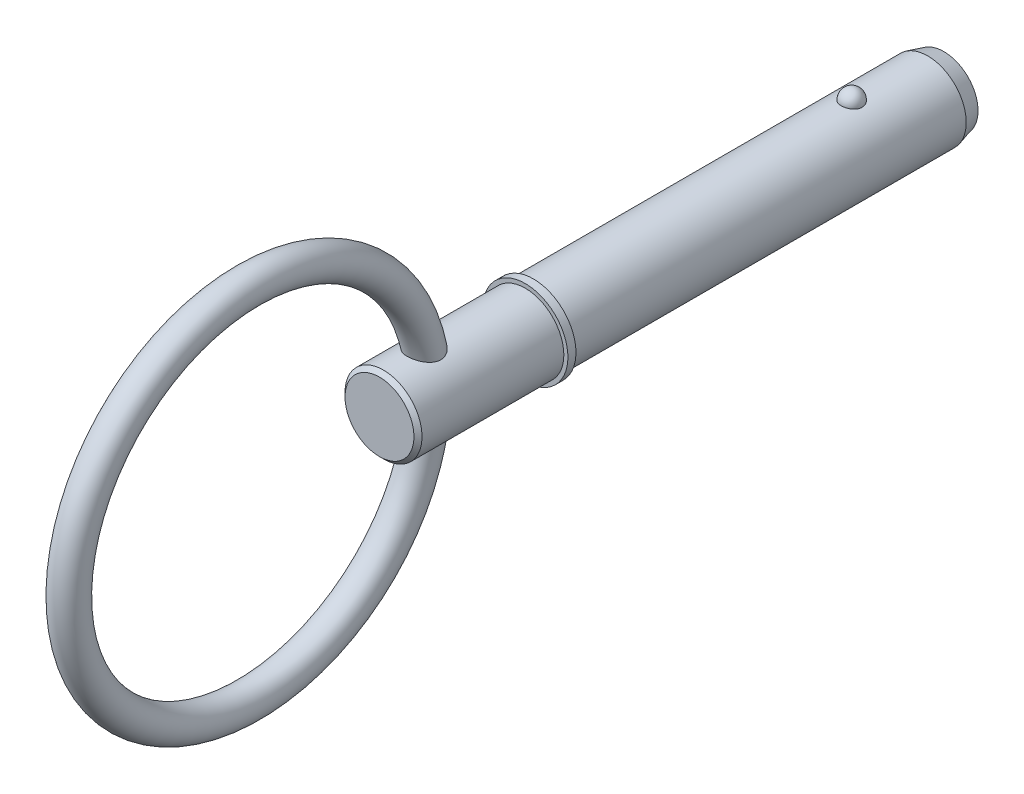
ISO-10303-21;
HEADER;
FILE_DESCRIPTION(('STEP AP214'),'2;1');
FILE_NAME('part.step','',(''),(''),'','','');
FILE_SCHEMA(('AUTOMOTIVE_DESIGN { 1 0 10303 214 1 1 1 1 }'));
ENDSEC;
DATA;
#1=APPLICATION_CONTEXT('core data for automotive mechanical design processes');
#2=APPLICATION_PROTOCOL_DEFINITION('international standard','automotive_design',2000,#1);
#3=PRODUCT_CONTEXT('',#1,'mechanical');
#4=PRODUCT('Part','Part','',(#3));
#5=PRODUCT_RELATED_PRODUCT_CATEGORY('part','',(#4));
#6=PRODUCT_DEFINITION_FORMATION('','',#4);
#7=PRODUCT_DEFINITION_CONTEXT('part definition',#1,'design');
#8=PRODUCT_DEFINITION('design','',#6,#7);
#9=PRODUCT_DEFINITION_SHAPE('','',#8);
#10=(LENGTH_UNIT() NAMED_UNIT(*) SI_UNIT(.MILLI.,.METRE.));
#11=(NAMED_UNIT(*) PLANE_ANGLE_UNIT() SI_UNIT($,.RADIAN.));
#12=(NAMED_UNIT(*) SI_UNIT($,.STERADIAN.) SOLID_ANGLE_UNIT());
#13=UNCERTAINTY_MEASURE_WITH_UNIT(LENGTH_MEASURE(1.E-05),#10,'distance_accuracy_value','');
#14=(GEOMETRIC_REPRESENTATION_CONTEXT(3) GLOBAL_UNCERTAINTY_ASSIGNED_CONTEXT((#13)) GLOBAL_UNIT_ASSIGNED_CONTEXT((#10,
#11,#12)) REPRESENTATION_CONTEXT('',''));
#15=CARTESIAN_POINT('',(0.,0.,0.));
#16=DIRECTION('',(0.,0.,1.));
#17=DIRECTION('',(1.,0.,0.));
#18=AXIS2_PLACEMENT_3D('',#15,#16,#17);
#19=CARTESIAN_POINT('',(0.,0.,38.1));
#20=DIRECTION('',(0.,0.,-1.));
#21=DIRECTION('',(-1.,0.,0.));
#22=AXIS2_PLACEMENT_3D('',#19,#20,#21);
#23=CYLINDRICAL_SURFACE('',#22,4.765);
#24=CARTESIAN_POINT('',(1.27812710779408,4.59038300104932,-1.29));
#25=CARTESIAN_POINT('',(1.27812572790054,4.59038414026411,-1.2178688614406));
#26=CARTESIAN_POINT('',(1.27223018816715,4.59203736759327,-1.14572000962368));
#27=CARTESIAN_POINT('',(1.24878929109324,4.59846646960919,-1.00346315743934));
#28=CARTESIAN_POINT('',(1.23123896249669,4.60324367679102,-0.933356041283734));
#29=CARTESIAN_POINT('',(1.18493861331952,4.61537801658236,-0.797215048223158));
#30=CARTESIAN_POINT('',(1.15619354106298,4.62273400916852,-0.731179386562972));
#31=CARTESIAN_POINT('',(1.08822596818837,4.6392032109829,-0.60498645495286));
#32=CARTESIAN_POINT('',(1.04900384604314,4.64831635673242,-0.544828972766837));
#33=CARTESIAN_POINT('',(0.960865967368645,4.66733302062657,-0.431775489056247));
#34=CARTESIAN_POINT('',(0.911906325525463,4.67723999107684,-0.37891426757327));
#35=CARTESIAN_POINT('',(0.805678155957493,4.69670280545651,-0.282245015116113));
#36=CARTESIAN_POINT('',(0.748409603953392,4.70625864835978,-0.238437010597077));
#37=CARTESIAN_POINT('',(0.627266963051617,4.72392767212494,-0.161207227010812));
#38=CARTESIAN_POINT('',(0.563411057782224,4.73204466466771,-0.127757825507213));
#39=CARTESIAN_POINT('',(0.430755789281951,4.74595788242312,-0.072047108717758));
#40=CARTESIAN_POINT('',(0.361956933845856,4.75175434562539,-0.0497846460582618));
#41=CARTESIAN_POINT('',(0.222605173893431,4.76030056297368,-0.017375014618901));
#42=CARTESIAN_POINT('',(0.152101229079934,4.76309991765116,-0.00703038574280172));
#43=CARTESIAN_POINT('',(0.0103009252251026,4.76551622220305,0.00191361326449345));
#44=CARTESIAN_POINT('',(-0.0609953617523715,4.76513345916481,0.000514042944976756));
#45=CARTESIAN_POINT('',(-0.201348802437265,4.76125496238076,-0.0138891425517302));
#46=CARTESIAN_POINT('',(-0.270423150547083,4.75780093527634,-0.0267372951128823));
#47=CARTESIAN_POINT('',(-0.405377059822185,4.74820737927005,-0.0634598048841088));
#48=CARTESIAN_POINT('',(-0.471256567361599,4.74206780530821,-0.087334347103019));
#49=CARTESIAN_POINT('',(-0.598375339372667,4.72771507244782,-0.145611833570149));
#50=CARTESIAN_POINT('',(-0.659587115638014,4.71949070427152,-0.180071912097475));
#51=CARTESIAN_POINT('',(-0.775356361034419,4.70185936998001,-0.258542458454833));
#52=CARTESIAN_POINT('',(-0.829913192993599,4.69245229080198,-0.302553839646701));
#53=CARTESIAN_POINT('',(-0.931895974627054,4.67327936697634,-0.39982907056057));
#54=CARTESIAN_POINT('',(-0.979176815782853,4.66351011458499,-0.453244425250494));
#55=CARTESIAN_POINT('',(-1.06421220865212,4.64484426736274,-0.567321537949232));
#56=CARTESIAN_POINT('',(-1.10196613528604,4.63594772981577,-0.6279837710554));
#57=CARTESIAN_POINT('',(-1.16735225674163,4.61992036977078,-0.75558557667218));
#58=CARTESIAN_POINT('',(-1.19487251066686,4.61280933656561,-0.822585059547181));
#59=CARTESIAN_POINT('',(-1.23851975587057,4.60128324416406,-0.96041771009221));
#60=CARTESIAN_POINT('',(-1.25464705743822,4.59686811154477,-1.03125077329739));
#61=CARTESIAN_POINT('',(-1.27505790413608,4.59124882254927,-1.17443804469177));
#62=CARTESIAN_POINT('',(-1.27938868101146,4.59003186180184,-1.24678501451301));
#63=CARTESIAN_POINT('',(-1.27623192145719,4.5909105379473,-1.3911989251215));
#64=CARTESIAN_POINT('',(-1.26874468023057,4.59300609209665,-1.46326587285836));
#65=CARTESIAN_POINT('',(-1.24220427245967,4.60025423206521,-1.60473192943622));
#66=CARTESIAN_POINT('',(-1.2232043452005,4.60539274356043,-1.67414176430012));
#67=CARTESIAN_POINT('',(-1.17415910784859,4.61813957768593,-1.80870154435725));
#68=CARTESIAN_POINT('',(-1.1441133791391,4.62574799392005,-1.87385132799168));
#69=CARTESIAN_POINT('',(-1.07354327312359,4.64263368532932,-1.99841604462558));
#70=CARTESIAN_POINT('',(-1.03296580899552,4.65191934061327,-2.05779976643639));
#71=CARTESIAN_POINT('',(-0.942433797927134,4.67110036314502,-2.16881966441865));
#72=CARTESIAN_POINT('',(-0.892478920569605,4.68099575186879,-2.22045556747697));
#73=CARTESIAN_POINT('',(-0.784302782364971,4.70033161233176,-2.31471696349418));
#74=CARTESIAN_POINT('',(-0.726054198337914,4.70977043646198,-2.35731146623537));
#75=CARTESIAN_POINT('',(-0.602997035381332,4.72709995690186,-2.43206620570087));
#76=CARTESIAN_POINT('',(-0.538188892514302,4.73499075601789,-2.46422713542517));
#77=CARTESIAN_POINT('',(-0.404639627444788,4.7482563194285,-2.51687454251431));
#78=CARTESIAN_POINT('',(-0.33595386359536,4.7536596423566,-2.53749415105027));
#79=CARTESIAN_POINT('',(-0.195948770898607,4.76148510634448,-2.56703727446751));
#80=CARTESIAN_POINT('',(-0.124629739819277,4.76390758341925,-2.57596210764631));
#81=CARTESIAN_POINT('',(0.0172696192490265,4.76548774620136,-2.58180339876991));
#82=CARTESIAN_POINT('',(0.0878407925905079,4.76470225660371,-2.57892886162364));
#83=CARTESIAN_POINT('',(0.227467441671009,4.76008019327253,-2.56172603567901));
#84=CARTESIAN_POINT('',(0.296522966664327,4.75624371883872,-2.54739811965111));
#85=CARTESIAN_POINT('',(0.430942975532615,4.74595041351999,-2.50776251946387));
#86=CARTESIAN_POINT('',(0.496319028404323,4.7395023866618,-2.4824917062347));
#87=CARTESIAN_POINT('',(0.621860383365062,4.72467083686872,-2.4216730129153));
#88=CARTESIAN_POINT('',(0.682025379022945,4.71628720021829,-2.38612452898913));
#89=CARTESIAN_POINT('',(0.796409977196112,4.69833598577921,-2.30511163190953));
#90=CARTESIAN_POINT('',(0.850529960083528,4.68875291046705,-2.25951003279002));
#91=CARTESIAN_POINT('',(0.950412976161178,4.66953243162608,-2.15992428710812));
#92=CARTESIAN_POINT('',(0.996174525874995,4.65989501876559,-2.10593865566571));
#93=CARTESIAN_POINT('',(1.07885962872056,4.64145616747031,-1.99009376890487));
#94=CARTESIAN_POINT('',(1.11562789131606,4.63267081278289,-1.92812106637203));
#95=CARTESIAN_POINT('',(1.17840570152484,4.61710269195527,-1.79873681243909));
#96=CARTESIAN_POINT('',(1.20441973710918,4.61031909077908,-1.73132754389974));
#97=CARTESIAN_POINT('',(1.24242116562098,4.60021170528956,-1.60192906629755));
#98=CARTESIAN_POINT('',(1.25578772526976,4.59655387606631,-1.54036674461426));
#99=CARTESIAN_POINT('',(1.27364121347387,4.59163904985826,-1.41587409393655));
#100=CARTESIAN_POINT('',(1.2781283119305,4.59038200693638,-1.35294379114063));
#101=CARTESIAN_POINT('',(1.27812710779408,4.59038300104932,-1.29));
#102=B_SPLINE_CURVE_WITH_KNOTS('',3,(#24,#25,#26,#27,#28,#29,#30,#31,#32,#33,#34,#35,#36,#37,
#38,#39,#40,#41,#42,#43,#44,#45,#46,#47,#48,#49,#50,#51,#52,#53,#54,#55,#56,#57,#58,#59,#60,#61,
#62,#63,#64,#65,#66,#67,#68,#69,#70,#71,#72,#73,#74,#75,#76,#77,#78,#79,#80,#81,#82,#83,#84,#85,
#86,#87,#88,#89,#90,#91,#92,#93,#94,#95,#96,#97,#98,#99,#100,#101),.UNSPECIFIED.,.T.,.F.,(4,2,2,
2,2,2,2,2,2,2,2,2,2,2,2,2,2,2,2,2,2,2,2,2,2,2,2,2,2,2,2,2,2,2,2,2,2,2,4),(0.,0.216167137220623,
0.432426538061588,0.648590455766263,0.864746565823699,1.0818998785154,1.29905382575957,
1.51562361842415,1.73217119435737,1.94507683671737,2.15796327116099,2.36800220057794,
2.57804465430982,2.78924132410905,3.00045819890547,3.21545551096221,3.43046692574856,
3.64776550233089,3.8650581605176,4.08147951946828,4.29789547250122,4.51331818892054,
4.72874907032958,4.94528769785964,5.16183395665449,5.37911087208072,5.59637335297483,
5.8110751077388,6.02575265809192,6.23664413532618,6.44752874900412,6.65770827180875,
6.86790014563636,7.08116060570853,7.29445887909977,7.51121476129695,7.72788009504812,
7.91651762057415,8.10515153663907),.UNSPECIFIED.);
#103=CARTESIAN_POINT('',(1.27812710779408,4.59038300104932,-1.29));
#104=VERTEX_POINT('',#103);
#105=EDGE_CURVE('E102',#104,#104,#102,.T.);
#106=ORIENTED_EDGE('',*,*,#105,.T.);
#107=EDGE_LOOP('',(#106));
#108=FACE_BOUND('',#107,.T.);
#109=CARTESIAN_POINT('',(0.,0.,-10.7));
#110=DIRECTION('',(0.,0.,-1.));
#111=DIRECTION('',(-1.,0.,0.));
#112=AXIS2_PLACEMENT_3D('',#109,#110,#111);
#113=CIRCLE('',#112,4.765);
#114=CARTESIAN_POINT('',(-4.765,0.,-10.7));
#115=VERTEX_POINT('',#114);
#116=EDGE_CURVE('E110',#115,#115,#113,.F.);
#117=ORIENTED_EDGE('',*,*,#116,.T.);
#118=EDGE_LOOP('',(#117));
#119=FACE_BOUND('',#118,.T.);
#120=CARTESIAN_POINT('',(0.,0.,38.1));
#121=DIRECTION('',(0.,0.,1.));
#122=DIRECTION('',(1.,0.,0.));
#123=AXIS2_PLACEMENT_3D('',#120,#121,#122);
#124=CIRCLE('',#123,4.765);
#125=CARTESIAN_POINT('',(4.765,0.,38.1));
#126=VERTEX_POINT('',#125);
#127=EDGE_CURVE('E108',#126,#126,#124,.T.);
#128=ORIENTED_EDGE('',*,*,#127,.F.);
#129=EDGE_LOOP('',(#128));
#130=FACE_BOUND('',#129,.T.);
#131=ADVANCED_FACE('F39',(#108,#119,#130),#23,.T.);
#132=CARTESIAN_POINT('',(0.,0.,-12.7));
#133=DIRECTION('',(0.,0.,-1.));
#134=DIRECTION('',(-1.,0.,0.));
#135=AXIS2_PLACEMENT_3D('',#132,#133,#134);
#136=PLANE('',#135);
#137=CARTESIAN_POINT('',(0.,0.,-12.7));
#138=DIRECTION('',(0.,0.,-1.));
#139=DIRECTION('',(-1.,0.,0.));
#140=AXIS2_PLACEMENT_3D('',#137,#138,#139);
#141=CIRCLE('',#140,4.22910161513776);
#142=CARTESIAN_POINT('',(-4.22910161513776,0.,-12.7));
#143=VERTEX_POINT('',#142);
#144=EDGE_CURVE('E142',#143,#143,#141,.T.);
#145=ORIENTED_EDGE('',*,*,#144,.T.);
#146=EDGE_LOOP('',(#145));
#147=FACE_BOUND('',#146,.T.);
#148=ADVANCED_FACE('F88',(#147),#136,.T.);
#149=CARTESIAN_POINT('',(0.,0.,-12.7));
#150=DIRECTION('',(0.,0.,1.));
#151=DIRECTION('',(1.,0.,0.));
#152=AXIS2_PLACEMENT_3D('',#149,#150,#151);
#153=CONICAL_SURFACE('',#152,4.22910161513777,0.261799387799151);
#154=ORIENTED_EDGE('',*,*,#116,.F.);
#155=EDGE_LOOP('',(#154));
#156=FACE_BOUND('',#155,.T.);
#157=ORIENTED_EDGE('',*,*,#144,.F.);
#158=EDGE_LOOP('',(#157));
#159=FACE_BOUND('',#158,.T.);
#160=ADVANCED_FACE('F94',(#156,#159),#153,.T.);
#161=CARTESIAN_POINT('',(0.,4.765,-1.29));
#162=DIRECTION('',(0.,1.,0.));
#163=DIRECTION('',(0.,0.,-1.));
#164=AXIS2_PLACEMENT_3D('',#161,#162,#163);
#165=SPHERICAL_SURFACE('',#164,1.29);
#166=ORIENTED_EDGE('',*,*,#105,.F.);
#167=EDGE_LOOP('',(#166));
#168=FACE_BOUND('',#167,.T.);
#169=ADVANCED_FACE('F113',(#168),#165,.T.);
#170=CARTESIAN_POINT('',(0.,0.,38.1));
#171=DIRECTION('',(0.,0.,-1.));
#172=DIRECTION('',(-1.,0.,0.));
#173=AXIS2_PLACEMENT_3D('',#170,#171,#172);
#174=PLANE('',#173);
#175=ORIENTED_EDGE('',*,*,#127,.T.);
#176=EDGE_LOOP('',(#175));
#177=FACE_BOUND('',#176,.T.);
#178=CARTESIAN_POINT('',(0.,0.,38.1));
#179=DIRECTION('',(0.,0.,-1.));
#180=DIRECTION('',(-1.,0.,0.));
#181=AXIS2_PLACEMENT_3D('',#178,#179,#180);
#182=CIRCLE('',#181,5.265);
#183=CARTESIAN_POINT('',(-5.265,0.,38.1));
#184=VERTEX_POINT('',#183);
#185=EDGE_CURVE('E109',#184,#184,#182,.T.);
#186=ORIENTED_EDGE('',*,*,#185,.T.);
#187=EDGE_LOOP('',(#186));
#188=FACE_BOUND('',#187,.T.);
#189=ADVANCED_FACE('F117',(#177,#188),#174,.T.);
#190=CARTESIAN_POINT('',(0.,0.,33.7287874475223));
#191=DIRECTION('',(0.,0.,-1.));
#192=DIRECTION('',(-1.,0.,0.));
#193=AXIS2_PLACEMENT_3D('',#190,#191,#192);
#194=CYLINDRICAL_SURFACE('',#193,5.265);
#195=CARTESIAN_POINT('',(0.,0.,39.1));
#196=DIRECTION('',(0.,0.,-1.));
#197=DIRECTION('',(-1.,0.,0.));
#198=AXIS2_PLACEMENT_3D('',#195,#196,#197);
#199=CIRCLE('',#198,5.265);
#200=CARTESIAN_POINT('',(-5.265,0.,39.1));
#201=VERTEX_POINT('',#200);
#202=EDGE_CURVE('E134',#201,#201,#199,.T.);
#203=ORIENTED_EDGE('',*,*,#202,.T.);
#204=EDGE_LOOP('',(#203));
#205=FACE_BOUND('',#204,.T.);
#206=ORIENTED_EDGE('',*,*,#185,.F.);
#207=EDGE_LOOP('',(#206));
#208=FACE_BOUND('',#207,.T.);
#209=ADVANCED_FACE('F121',(#205,#208),#194,.T.);
#210=CARTESIAN_POINT('',(0.,5.265,39.1));
#211=DIRECTION('',(0.,0.,1.));
#212=DIRECTION('',(1.,0.,0.));
#213=AXIS2_PLACEMENT_3D('',#210,#211,#212);
#214=PLANE('',#213);
#215=CARTESIAN_POINT('',(0.,0.,39.1));
#216=DIRECTION('',(0.,0.,1.));
#217=DIRECTION('',(1.,0.,0.));
#218=AXIS2_PLACEMENT_3D('',#215,#216,#217);
#219=CIRCLE('',#218,4.765);
#220=CARTESIAN_POINT('',(4.765,0.,39.1));
#221=VERTEX_POINT('',#220);
#222=EDGE_CURVE('E112',#221,#221,#219,.T.);
#223=ORIENTED_EDGE('',*,*,#222,.F.);
#224=EDGE_LOOP('',(#223));
#225=FACE_BOUND('',#224,.T.);
#226=ORIENTED_EDGE('',*,*,#202,.F.);
#227=EDGE_LOOP('',(#226));
#228=FACE_BOUND('',#227,.T.);
#229=ADVANCED_FACE('F85',(#225,#228),#214,.T.);
#230=CARTESIAN_POINT('',(0.,0.,57.15));
#231=DIRECTION('',(0.,0.,-1.));
#232=DIRECTION('',(-1.,0.,0.));
#233=AXIS2_PLACEMENT_3D('',#230,#231,#232);
#234=CYLINDRICAL_SURFACE('',#233,4.765);
#235=CARTESIAN_POINT('',(-1.17603588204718,-4.61759294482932,49.9837200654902));
#236=CARTESIAN_POINT('',(-1.08605054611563,-4.6405075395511,49.9215688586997));
#237=CARTESIAN_POINT('',(-0.990486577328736,-4.66202408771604,49.8667393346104));
#238=CARTESIAN_POINT('',(-0.790762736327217,-4.70002969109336,49.7729957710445));
#239=CARTESIAN_POINT('',(-0.686587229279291,-4.7165093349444,49.7341114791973));
#240=CARTESIAN_POINT('',(-0.472539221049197,-4.7427361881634,49.673267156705));
#241=CARTESIAN_POINT('',(-0.362665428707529,-4.7524818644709,49.6513109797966));
#242=CARTESIAN_POINT('',(-0.140482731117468,-4.7642267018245,49.6249366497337));
#243=CARTESIAN_POINT('',(-0.0281752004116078,-4.7662301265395,49.6205088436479));
#244=CARTESIAN_POINT('',(0.193745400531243,-4.76233166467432,49.6292082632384));
#245=CARTESIAN_POINT('',(0.303372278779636,-4.75656024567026,49.6420457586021));
#246=CARTESIAN_POINT('',(0.518724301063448,-4.73791484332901,49.6844340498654));
#247=CARTESIAN_POINT('',(0.624448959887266,-4.72503997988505,49.7139869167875));
#248=CARTESIAN_POINT('',(0.829434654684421,-4.69340588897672,49.7892085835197));
#249=CARTESIAN_POINT('',(0.92867434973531,-4.6746283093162,49.8349277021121));
#250=CARTESIAN_POINT('',(1.11777413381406,-4.63305392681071,49.9414733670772));
#251=CARTESIAN_POINT('',(1.20763216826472,-4.61025624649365,50.0023032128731));
#252=CARTESIAN_POINT('',(1.37762760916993,-4.56238439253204,50.1394393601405));
#253=CARTESIAN_POINT('',(1.45749020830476,-4.53726959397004,50.2160728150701));
#254=CARTESIAN_POINT('',(1.60275140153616,-4.48801828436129,50.3822939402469));
#255=CARTESIAN_POINT('',(1.66815155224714,-4.46388166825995,50.471880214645));
#256=CARTESIAN_POINT('',(1.78162069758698,-4.41980966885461,50.6604689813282));
#257=CARTESIAN_POINT('',(1.82993675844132,-4.3998162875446,50.7593086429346));
#258=CARTESIAN_POINT('',(1.90902953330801,-4.36608532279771,50.9647395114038));
#259=CARTESIAN_POINT('',(1.93981696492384,-4.35234391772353,51.0713259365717));
#260=CARTESIAN_POINT('',(1.9818112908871,-4.33337618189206,51.2823805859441));
#261=CARTESIAN_POINT('',(1.99406945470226,-4.32769391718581,51.38660066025));
#262=CARTESIAN_POINT('',(2.0025484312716,-4.32377679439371,51.5958125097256));
#263=CARTESIAN_POINT('',(1.99876733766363,-4.32554282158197,51.7008043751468));
#264=CARTESIAN_POINT('',(1.97595504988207,-4.33600911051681,51.9091056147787));
#265=CARTESIAN_POINT('',(1.95686739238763,-4.3447350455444,52.0124073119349));
#266=CARTESIAN_POINT('',(1.90457346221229,-4.36790947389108,52.2146792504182));
#267=CARTESIAN_POINT('',(1.87136191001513,-4.38236010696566,52.3136478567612));
#268=CARTESIAN_POINT('',(1.78747856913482,-4.41728816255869,52.5164706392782));
#269=CARTESIAN_POINT('',(1.73524632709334,-4.43826528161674,52.6195927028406));
#270=CARTESIAN_POINT('',(1.61607256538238,-4.48303292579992,52.8163865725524));
#271=CARTESIAN_POINT('',(1.5491157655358,-4.50682636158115,52.9100484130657));
#272=CARTESIAN_POINT('',(1.39359064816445,-4.55746895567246,53.0953838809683));
#273=CARTESIAN_POINT('',(1.30346928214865,-4.58437060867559,53.1857503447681));
#274=CARTESIAN_POINT('',(1.10794390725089,-4.6354985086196,53.3490111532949));
#275=CARTESIAN_POINT('',(1.00255934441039,-4.65972809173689,53.4219274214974));
#276=CARTESIAN_POINT('',(0.803761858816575,-4.69755503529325,53.5324077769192));
#277=CARTESIAN_POINT('',(0.712935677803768,-4.71231838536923,53.5742306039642));
#278=CARTESIAN_POINT('',(0.525172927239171,-4.73691370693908,53.6429362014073));
#279=CARTESIAN_POINT('',(0.428242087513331,-4.7467502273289,53.6698327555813));
#280=CARTESIAN_POINT('',(0.230351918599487,-4.76046566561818,53.7071470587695));
#281=CARTESIAN_POINT('',(0.129376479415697,-4.76431768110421,53.7174904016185));
#282=CARTESIAN_POINT('',(-0.0728965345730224,-4.76551495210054,53.7207168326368));
#283=CARTESIAN_POINT('',(-0.174194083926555,-4.76286070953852,53.7136012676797));
#284=CARTESIAN_POINT('',(-0.366467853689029,-4.751792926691,53.6835798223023));
#285=CARTESIAN_POINT('',(-0.457659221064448,-4.74381187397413,53.6618588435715));
#286=CARTESIAN_POINT('',(-0.63522668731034,-4.72331548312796,53.6050844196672));
#287=CARTESIAN_POINT('',(-0.721601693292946,-4.71079912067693,53.5700279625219));
#288=CARTESIAN_POINT('',(-0.893212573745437,-4.68139468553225,53.4855597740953));
#289=CARTESIAN_POINT('',(-0.978027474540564,-4.66427939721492,53.4353775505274));
#290=CARTESIAN_POINT('',(-1.13917803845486,-4.62756330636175,53.3236420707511));
#291=CARTESIAN_POINT('',(-1.21550961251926,-4.60796131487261,53.2620833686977));
#292=CARTESIAN_POINT('',(-1.37033540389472,-4.56452178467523,53.1186885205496));
#293=CARTESIAN_POINT('',(-1.44723650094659,-4.5405070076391,53.0351843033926));
#294=CARTESIAN_POINT('',(-1.587638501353,-4.49334232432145,52.8572920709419));
#295=CARTESIAN_POINT('',(-1.65112672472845,-4.47019325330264,52.7628938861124));
#296=CARTESIAN_POINT('',(-1.77033243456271,-4.42444393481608,52.5532060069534));
#297=CARTESIAN_POINT('',(-1.82420433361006,-4.40224259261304,52.4367685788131));
#298=CARTESIAN_POINT('',(-1.91169086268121,-4.36496831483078,52.1954090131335));
#299=CARTESIAN_POINT('',(-1.94531523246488,-4.34989195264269,52.0704909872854));
#300=CARTESIAN_POINT('',(-1.98892523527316,-4.33012255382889,51.8220163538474));
#301=CARTESIAN_POINT('',(-1.99998275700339,-4.32495941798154,51.6986899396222));
#302=CARTESIAN_POINT('',(-2.00001713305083,-4.32494814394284,51.4520738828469));
#303=CARTESIAN_POINT('',(-1.98902141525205,-4.33008719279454,51.3287843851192));
#304=CARTESIAN_POINT('',(-1.94752572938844,-4.34888267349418,51.1032137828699));
#305=CARTESIAN_POINT('',(-1.91979754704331,-4.36132278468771,51.0003106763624));
#306=CARTESIAN_POINT('',(-1.84805595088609,-4.39220107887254,50.8012512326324));
#307=CARTESIAN_POINT('',(-1.80403476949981,-4.4106421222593,50.7050981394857));
#308=CARTESIAN_POINT('',(-1.70232000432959,-4.4508689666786,50.5244579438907));
#309=CARTESIAN_POINT('',(-1.64499853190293,-4.47255887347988,50.4397380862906));
#310=CARTESIAN_POINT('',(-1.51770958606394,-4.51733419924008,50.2810122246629));
#311=CARTESIAN_POINT('',(-1.44776268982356,-4.54041730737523,50.2069891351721));
#312=CARTESIAN_POINT('',(-1.34143544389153,-4.57239833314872,50.11104340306));
#313=CARTESIAN_POINT('',(-1.30955259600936,-4.58164274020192,50.0841153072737));
#314=CARTESIAN_POINT('',(-1.24406394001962,-4.59985727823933,50.0323409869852));
#315=CARTESIAN_POINT('',(-1.21045807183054,-4.6088273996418,50.0074948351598));
#316=CARTESIAN_POINT('',(-1.17603588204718,-4.61759294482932,49.9837200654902));
#317=B_SPLINE_CURVE_WITH_KNOTS('',3,(#235,#236,#237,#238,#239,#240,#241,#242,#243,#244,#245,
#246,#247,#248,#249,#250,#251,#252,#253,#254,#255,#256,#257,#258,#259,#260,#261,#262,#263,#264,
#265,#266,#267,#268,#269,#270,#271,#272,#273,#274,#275,#276,#277,#278,#279,#280,#281,#282,#283,
#284,#285,#286,#287,#288,#289,#290,#291,#292,#293,#294,#295,#296,#297,#298,#299,#300,#301,#302,
#303,#304,#305,#306,#307,#308,#309,#310,#311,#312,#313,#314,#315,#316),.UNSPECIFIED.,.T.,.F.,(4,
2,2,2,2,2,2,2,2,2,2,2,2,2,2,2,2,2,2,2,2,2,2,2,2,2,2,2,2,2,2,2,2,2,2,2,2,2,2,2,4),(0.,
0.335054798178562,0.670731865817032,1.00648532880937,1.34205386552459,1.67206089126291,
2.00210881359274,2.33319321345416,2.66434996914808,3.00321157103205,3.34203668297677,
3.67573940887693,4.0092378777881,4.32299322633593,4.6367858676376,4.95174139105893,
5.26681474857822,5.6178575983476,5.96926647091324,6.35862694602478,6.74749565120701,
7.04947204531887,7.35116911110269,7.65421852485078,7.95724456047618,8.23825252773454,
8.51932400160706,8.81825171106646,9.11732288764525,9.46404422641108,9.81109188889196,
10.1997682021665,10.5882573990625,10.9578189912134,11.32692124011,11.6472091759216,
11.9676500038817,12.2800235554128,12.5918925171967,12.7200569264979,12.8482258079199),.UNSPECIFIED.);
#318=CARTESIAN_POINT('',(-1.17603588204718,-4.61759294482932,49.9837200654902));
#319=VERTEX_POINT('',#318);
#320=EDGE_CURVE('E10',#319,#319,#317,.T.);
#321=ORIENTED_EDGE('',*,*,#320,.F.);
#322=EDGE_LOOP('',(#321));
#323=FACE_BOUND('',#322,.T.);
#324=CARTESIAN_POINT('',(-1.17603588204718,4.61759294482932,49.9837200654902));
#325=CARTESIAN_POINT('',(-1.26499234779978,4.59493450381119,50.0451699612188));
#326=CARTESIAN_POINT('',(-1.34870034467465,4.57085993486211,50.1139152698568));
#327=CARTESIAN_POINT('',(-1.50334626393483,4.52236448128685,50.264635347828));
#328=CARTESIAN_POINT('',(-1.57425996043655,4.49794303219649,50.3466346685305));
#329=CARTESIAN_POINT('',(-1.7013018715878,4.45144771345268,50.5222345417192));
#330=CARTESIAN_POINT('',(-1.75740699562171,4.42937754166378,50.6158528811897));
#331=CARTESIAN_POINT('',(-1.85287755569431,4.39030189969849,50.8121668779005));
#332=CARTESIAN_POINT('',(-1.89225871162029,4.37329167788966,50.9148539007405));
#333=CARTESIAN_POINT('',(-1.95188661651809,4.34699775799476,51.1218576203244));
#334=CARTESIAN_POINT('',(-1.97286468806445,4.33742068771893,51.2259265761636));
#335=CARTESIAN_POINT('',(-1.99814509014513,4.32583397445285,51.4364714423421));
#336=CARTESIAN_POINT('',(-2.00244696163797,4.32382453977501,51.5429474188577));
#337=CARTESIAN_POINT('',(-1.99499900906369,4.32726361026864,51.7527706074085));
#338=CARTESIAN_POINT('',(-1.9836061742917,4.33254625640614,51.856134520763));
#339=CARTESIAN_POINT('',(-1.94643618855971,4.34936983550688,52.0596911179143));
#340=CARTESIAN_POINT('',(-1.92065444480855,4.3609127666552,52.1598827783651));
#341=CARTESIAN_POINT('',(-1.85292379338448,4.3901452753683,52.3641042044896));
#342=CARTESIAN_POINT('',(-1.80971134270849,4.40830066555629,52.4676462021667));
#343=CARTESIAN_POINT('',(-1.70892742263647,4.44833985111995,52.6667684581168));
#344=CARTESIAN_POINT('',(-1.65134284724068,4.47022704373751,52.7623413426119));
#345=CARTESIAN_POINT('',(-1.51475300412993,4.51847764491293,52.9552600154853));
#346=CARTESIAN_POINT('',(-1.43395667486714,4.54505660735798,53.0512914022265));
#347=CARTESIAN_POINT('',(-1.25684082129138,4.59718102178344,53.2281328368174));
#348=CARTESIAN_POINT('',(-1.1605312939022,4.62272712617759,53.3089526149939));
#349=CARTESIAN_POINT('',(-0.972192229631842,4.66558476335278,53.4393265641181));
#350=CARTESIAN_POINT('',(-0.882391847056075,4.68355428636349,53.4918799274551));
#351=CARTESIAN_POINT('',(-0.694836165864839,4.71502283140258,53.5820221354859));
#352=CARTESIAN_POINT('',(-0.597087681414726,4.72852563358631,53.6196236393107));
#353=CARTESIAN_POINT('',(-0.395321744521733,4.74966109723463,53.6778751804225));
#354=CARTESIAN_POINT('',(-0.291269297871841,4.75725698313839,53.6984190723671));
#355=CARTESIAN_POINT('',(-0.080897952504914,4.76547327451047,53.7206246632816));
#356=CARTESIAN_POINT('',(0.0254198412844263,4.76609700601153,53.7222953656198));
#357=CARTESIAN_POINT('',(0.225327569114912,4.7606097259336,53.7074850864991));
#358=CARTESIAN_POINT('',(0.31908414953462,4.75519734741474,53.6928871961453));
#359=CARTESIAN_POINT('',(0.502750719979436,4.73930039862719,53.6493972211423));
#360=CARTESIAN_POINT('',(0.592660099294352,4.72881502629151,53.620502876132));
#361=CARTESIAN_POINT('',(0.768777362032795,4.70343779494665,53.5490413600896));
#362=CARTESIAN_POINT('',(0.854839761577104,4.68844387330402,53.5061552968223));
#363=CARTESIAN_POINT('',(1.01943666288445,4.65543047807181,53.4087469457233));
#364=CARTESIAN_POINT('',(1.09796821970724,4.63740982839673,53.3542201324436));
#365=CARTESIAN_POINT('',(1.25751825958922,4.59691257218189,53.2264656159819));
#366=CARTESIAN_POINT('',(1.33721103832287,4.57417011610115,53.1516678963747));
#367=CARTESIAN_POINT('',(1.48461190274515,4.52847869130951,52.9910829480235));
#368=CARTESIAN_POINT('',(1.55230949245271,4.50552956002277,52.9052862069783));
#369=CARTESIAN_POINT('',(1.68366050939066,4.45825797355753,52.7114045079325));
#370=CARTESIAN_POINT('',(1.74532014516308,4.4342153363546,52.6018899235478));
#371=CARTESIAN_POINT('',(1.85007805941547,4.39154308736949,52.3732696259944));
#372=CARTESIAN_POINT('',(1.89317429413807,4.37291407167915,52.2541628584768));
#373=CARTESIAN_POINT('',(1.958572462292,4.34402041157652,52.0097631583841));
#374=CARTESIAN_POINT('',(1.98095022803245,4.33372528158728,51.884494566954));
#375=CARTESIAN_POINT('',(2.00301292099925,4.32358016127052,51.6315942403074));
#376=CARTESIAN_POINT('',(2.00273000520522,4.32371536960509,51.5039661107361));
#377=CARTESIAN_POINT('',(1.97997568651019,4.3341693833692,51.2682474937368));
#378=CARTESIAN_POINT('',(1.96044562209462,4.34313814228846,51.1598066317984));
#379=CARTESIAN_POINT('',(1.90368145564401,4.36831534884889,50.9485431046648));
#380=CARTESIAN_POINT('',(1.86644884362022,4.38452318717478,50.8457199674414));
#381=CARTESIAN_POINT('',(1.7781154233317,4.42104679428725,50.6547100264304));
#382=CARTESIAN_POINT('',(1.72797707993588,4.44105894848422,50.5660156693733));
#383=CARTESIAN_POINT('',(1.61439500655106,4.48359504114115,50.3982868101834));
#384=CARTESIAN_POINT('',(1.55094927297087,4.50611935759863,50.3192537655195));
#385=CARTESIAN_POINT('',(1.40889349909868,4.55259151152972,50.1687053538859));
#386=CARTESIAN_POINT('',(1.32968750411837,4.57655455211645,50.0977571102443));
#387=CARTESIAN_POINT('',(1.16035884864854,4.62238936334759,49.9695060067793));
#388=CARTESIAN_POINT('',(1.070233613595,4.64426063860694,49.9122063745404));
#389=CARTESIAN_POINT('',(0.877362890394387,4.68460759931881,49.8103166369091));
#390=CARTESIAN_POINT('',(0.774249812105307,4.70290564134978,49.7663495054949));
#391=CARTESIAN_POINT('',(0.561430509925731,4.73302876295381,49.6954843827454));
#392=CARTESIAN_POINT('',(0.45172542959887,4.74485496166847,49.6685834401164));
#393=CARTESIAN_POINT('',(0.230282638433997,4.76071009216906,49.6327633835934));
#394=CARTESIAN_POINT('',(0.118587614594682,4.76483485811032,49.6236232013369));
#395=CARTESIAN_POINT('',(-0.104911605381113,4.76515532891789,49.6229082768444));
#396=CARTESIAN_POINT('',(-0.216715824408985,4.76134861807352,49.6313388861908));
#397=CARTESIAN_POINT('',(-0.435231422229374,4.74632552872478,49.6652456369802));
#398=CARTESIAN_POINT('',(-0.541996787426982,4.73523460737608,49.6904332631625));
#399=CARTESIAN_POINT('',(-0.749371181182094,4.70686626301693,49.7569215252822));
#400=CARTESIAN_POINT('',(-0.849990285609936,4.68959930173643,49.7981949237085));
#401=CARTESIAN_POINT('',(-0.986108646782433,4.6620261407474,49.8672359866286));
#402=CARTESIAN_POINT('',(-1.02525769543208,4.65355983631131,49.8887724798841));
#403=CARTESIAN_POINT('',(-1.10191286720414,4.63600664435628,49.9343673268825));
#404=CARTESIAN_POINT('',(-1.13941901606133,4.62691976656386,49.958425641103));
#405=CARTESIAN_POINT('',(-1.17603588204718,4.61759294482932,49.9837200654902));
#406=B_SPLINE_CURVE_WITH_KNOTS('',3,(#324,#325,#326,#327,#328,#329,#330,#331,#332,#333,#334,
#335,#336,#337,#338,#339,#340,#341,#342,#343,#344,#345,#346,#347,#348,#349,#350,#351,#352,#353,
#354,#355,#356,#357,#358,#359,#360,#361,#362,#363,#364,#365,#366,#367,#368,#369,#370,#371,#372,
#373,#374,#375,#376,#377,#378,#379,#380,#381,#382,#383,#384,#385,#386,#387,#388,#389,#390,#391,
#392,#393,#394,#395,#396,#397,#398,#399,#400,#401,#402,#403,#404,#405),.UNSPECIFIED.,.T.,.F.,(4,
2,2,2,2,2,2,2,2,2,2,2,2,2,2,2,2,2,2,2,2,2,2,2,2,2,2,2,2,2,2,2,2,2,2,2,2,2,2,2,4),(0.,
0.331234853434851,0.66309046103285,0.995460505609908,1.3275174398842,1.64568783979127,
1.96386699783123,2.2749271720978,2.58608669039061,2.92571998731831,3.26566413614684,
3.64875195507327,4.03159388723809,4.34706664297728,4.66227172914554,4.97942386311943,
5.29642469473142,5.58021908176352,5.86405835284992,6.15488068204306,6.44581627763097,
6.77943874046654,7.11335170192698,7.49545660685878,7.87760356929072,8.25834622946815,
8.63854860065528,8.96843568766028,9.29829501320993,9.60842872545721,9.91860916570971,
10.2441707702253,10.5698092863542,10.9089029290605,11.2479379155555,11.5827251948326,
11.9176144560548,12.2468820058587,12.5755944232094,12.7119417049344,12.8482868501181),.UNSPECIFIED.);
#407=CARTESIAN_POINT('',(-1.17603588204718,4.61759294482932,49.9837200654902));
#408=VERTEX_POINT('',#407);
#409=EDGE_CURVE('E51',#408,#408,#406,.T.);
#410=ORIENTED_EDGE('',*,*,#409,.F.);
#411=EDGE_LOOP('',(#410));
#412=FACE_BOUND('',#411,.T.);
#413=CARTESIAN_POINT('',(0.,0.,56.65));
#414=DIRECTION('',(0.,0.,-1.));
#415=DIRECTION('',(-1.,0.,0.));
#416=AXIS2_PLACEMENT_3D('',#413,#414,#415);
#417=CIRCLE('',#416,4.765);
#418=CARTESIAN_POINT('',(-4.765,0.,56.65));
#419=VERTEX_POINT('',#418);
#420=EDGE_CURVE('E64',#419,#419,#417,.T.);
#421=ORIENTED_EDGE('',*,*,#420,.T.);
#422=EDGE_LOOP('',(#421));
#423=FACE_BOUND('',#422,.T.);
#424=ORIENTED_EDGE('',*,*,#222,.T.);
#425=EDGE_LOOP('',(#424));
#426=FACE_BOUND('',#425,.T.);
#427=ADVANCED_FACE('F69',(#323,#412,#423,#426),#234,.T.);
#428=CARTESIAN_POINT('',(0.,0.,57.15));
#429=DIRECTION('',(0.,0.,-1.));
#430=DIRECTION('',(-1.,0.,0.));
#431=AXIS2_PLACEMENT_3D('',#428,#429,#430);
#432=PLANE('',#431);
#433=CARTESIAN_POINT('',(0.,0.,57.15));
#434=DIRECTION('',(0.,0.,-1.));
#435=DIRECTION('',(-1.,0.,0.));
#436=AXIS2_PLACEMENT_3D('',#433,#434,#435);
#437=CIRCLE('',#436,4.26499999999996);
#438=CARTESIAN_POINT('',(-4.26499999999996,0.,57.15));
#439=VERTEX_POINT('',#438);
#440=EDGE_CURVE('E58',#439,#439,#437,.F.);
#441=ORIENTED_EDGE('',*,*,#440,.T.);
#442=EDGE_LOOP('',(#441));
#443=FACE_BOUND('',#442,.T.);
#444=ADVANCED_FACE('F76',(#443),#432,.F.);
#445=CARTESIAN_POINT('',(0.,0.,56.65));
#446=DIRECTION('',(0.,0.,-1.));
#447=DIRECTION('',(-1.,0.,0.));
#448=AXIS2_PLACEMENT_3D('',#445,#446,#447);
#449=CONICAL_SURFACE('',#448,4.765,0.785398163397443);
#450=ORIENTED_EDGE('',*,*,#440,.F.);
#451=EDGE_LOOP('',(#450));
#452=FACE_BOUND('',#451,.T.);
#453=ORIENTED_EDGE('',*,*,#420,.F.);
#454=EDGE_LOOP('',(#453));
#455=FACE_BOUND('',#454,.T.);
#456=ADVANCED_FACE('F41',(#452,#455),#449,.T.);
#457=CARTESIAN_POINT('',(0.,0.,73.375));
#458=DIRECTION('',(1.,0.,0.));
#459=DIRECTION('',(0.,0.,-1.));
#460=AXIS2_PLACEMENT_3D('',#457,#458,#459);
#461=TOROIDAL_SURFACE('',#460,22.225,2.);
#462=ORIENTED_EDGE('',*,*,#320,.T.);
#463=EDGE_LOOP('',(#462));
#464=FACE_BOUND('',#463,.T.);
#465=ORIENTED_EDGE('',*,*,#409,.T.);
#466=EDGE_LOOP('',(#465));
#467=FACE_BOUND('',#466,.T.);
#468=ADVANCED_FACE('F73',(#464,#467),#461,.T.);
#469=CLOSED_SHELL('',(#131,#148,#160,#169,#189,#209,#229,#427,#444,#456,#468));
#470=MANIFOLD_SOLID_BREP('B2',#469);
#471=ADVANCED_BREP_SHAPE_REPRESENTATION('',(#18,#470),#14);
#472=SHAPE_DEFINITION_REPRESENTATION(#9,#471);
ENDSEC;
END-ISO-10303-21;
